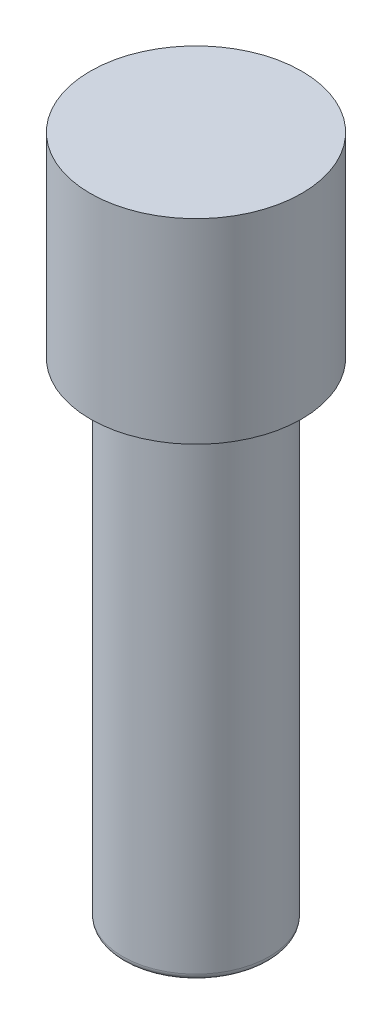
ISO-10303-21;
HEADER;
FILE_DESCRIPTION(('STEP AP214'),'2;1');
FILE_NAME('part.step','',(''),(''),'','','');
FILE_SCHEMA(('AUTOMOTIVE_DESIGN { 1 0 10303 214 1 1 1 1 }'));
ENDSEC;
DATA;
#1=APPLICATION_CONTEXT('core data for automotive mechanical design processes');
#2=APPLICATION_PROTOCOL_DEFINITION('international standard','automotive_design',2000,#1);
#3=PRODUCT_CONTEXT('',#1,'mechanical');
#4=PRODUCT('Part','Part','',(#3));
#5=PRODUCT_RELATED_PRODUCT_CATEGORY('part','',(#4));
#6=PRODUCT_DEFINITION_FORMATION('','',#4);
#7=PRODUCT_DEFINITION_CONTEXT('part definition',#1,'design');
#8=PRODUCT_DEFINITION('design','',#6,#7);
#9=PRODUCT_DEFINITION_SHAPE('','',#8);
#10=(LENGTH_UNIT() NAMED_UNIT(*) SI_UNIT(.MILLI.,.METRE.));
#11=(NAMED_UNIT(*) PLANE_ANGLE_UNIT() SI_UNIT($,.RADIAN.));
#12=(NAMED_UNIT(*) SI_UNIT($,.STERADIAN.) SOLID_ANGLE_UNIT());
#13=UNCERTAINTY_MEASURE_WITH_UNIT(LENGTH_MEASURE(1.E-05),#10,'distance_accuracy_value','');
#14=(GEOMETRIC_REPRESENTATION_CONTEXT(3) GLOBAL_UNCERTAINTY_ASSIGNED_CONTEXT((#13)) GLOBAL_UNIT_ASSIGNED_CONTEXT((#10,
#11,#12)) REPRESENTATION_CONTEXT('',''));
#15=CARTESIAN_POINT('',(0.,0.,0.));
#16=DIRECTION('',(0.,0.,1.));
#17=DIRECTION('',(1.,0.,0.));
#18=AXIS2_PLACEMENT_3D('',#15,#16,#17);
#19=CARTESIAN_POINT('',(0.,0.,0.));
#20=DIRECTION('',(0.,1.,0.));
#21=DIRECTION('',(0.,0.,1.));
#22=AXIS2_PLACEMENT_3D('',#19,#20,#21);
#23=PLANE('',#22);
#24=CARTESIAN_POINT('',(0.,0.,0.));
#25=DIRECTION('',(0.,1.,0.));
#26=DIRECTION('',(0.,0.,1.));
#27=AXIS2_PLACEMENT_3D('',#24,#25,#26);
#28=CIRCLE('',#27,2.05);
#29=CARTESIAN_POINT('',(0.,0.,2.05));
#30=VERTEX_POINT('',#29);
#31=EDGE_CURVE('E10',#30,#30,#28,.F.);
#32=ORIENTED_EDGE('',*,*,#31,.T.);
#33=EDGE_LOOP('',(#32));
#34=FACE_BOUND('',#33,.T.);
#35=CARTESIAN_POINT('',(0.,0.,0.));
#36=DIRECTION('',(0.,1.,0.));
#37=DIRECTION('',(0.,0.,1.));
#38=AXIS2_PLACEMENT_3D('',#35,#36,#37);
#39=CIRCLE('',#38,1.4);
#40=CARTESIAN_POINT('',(0.,0.,1.4));
#41=VERTEX_POINT('',#40);
#42=EDGE_CURVE('E42',#41,#41,#39,.T.);
#43=ORIENTED_EDGE('',*,*,#42,.T.);
#44=EDGE_LOOP('',(#43));
#45=FACE_BOUND('',#44,.T.);
#46=ADVANCED_FACE('F31',(#34,#45),#23,.F.);
#47=CARTESIAN_POINT('',(0.,10.,0.));
#48=DIRECTION('',(0.,-1.,0.));
#49=DIRECTION('',(0.,0.,-1.));
#50=AXIS2_PLACEMENT_3D('',#47,#48,#49);
#51=CYLINDRICAL_SURFACE('',#50,2.25);
#52=CARTESIAN_POINT('',(0.,0.200000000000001,0.));
#53=DIRECTION('',(0.,1.,0.));
#54=DIRECTION('',(0.,0.,1.));
#55=AXIS2_PLACEMENT_3D('',#52,#53,#54);
#56=CIRCLE('',#55,2.25);
#57=CARTESIAN_POINT('',(0.,0.200000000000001,2.25));
#58=VERTEX_POINT('',#57);
#59=EDGE_CURVE('E38',#58,#58,#56,.T.);
#60=ORIENTED_EDGE('',*,*,#59,.T.);
#61=EDGE_LOOP('',(#60));
#62=FACE_BOUND('',#61,.T.);
#63=CARTESIAN_POINT('',(0.,15.,0.));
#64=DIRECTION('',(0.,1.,0.));
#65=DIRECTION('',(0.,0.,1.));
#66=AXIS2_PLACEMENT_3D('',#63,#64,#65);
#67=CIRCLE('',#66,2.25);
#68=CARTESIAN_POINT('',(0.,15.,2.25));
#69=VERTEX_POINT('',#68);
#70=EDGE_CURVE('E51',#69,#69,#67,.T.);
#71=ORIENTED_EDGE('',*,*,#70,.F.);
#72=EDGE_LOOP('',(#71));
#73=FACE_BOUND('',#72,.T.);
#74=ADVANCED_FACE('F78',(#62,#73),#51,.T.);
#75=CARTESIAN_POINT('',(0.,10.,0.));
#76=DIRECTION('',(0.,-1.,0.));
#77=DIRECTION('',(0.,0.,-1.));
#78=AXIS2_PLACEMENT_3D('',#75,#76,#77);
#79=CYLINDRICAL_SURFACE('',#78,1.4);
#80=CARTESIAN_POINT('',(0.,10.,0.));
#81=DIRECTION('',(0.,1.,0.));
#82=DIRECTION('',(0.,0.,1.));
#83=AXIS2_PLACEMENT_3D('',#80,#81,#82);
#84=CIRCLE('',#83,1.4);
#85=CARTESIAN_POINT('',(0.,10.,1.4));
#86=VERTEX_POINT('',#85);
#87=EDGE_CURVE('E46',#86,#86,#84,.T.);
#88=ORIENTED_EDGE('',*,*,#87,.T.);
#89=EDGE_LOOP('',(#88));
#90=FACE_BOUND('',#89,.T.);
#91=ORIENTED_EDGE('',*,*,#42,.F.);
#92=EDGE_LOOP('',(#91));
#93=FACE_BOUND('',#92,.T.);
#94=ADVANCED_FACE('F83',(#90,#93),#79,.F.);
#95=CARTESIAN_POINT('',(0.,10.,0.));
#96=DIRECTION('',(0.,1.,0.));
#97=DIRECTION('',(0.,0.,1.));
#98=AXIS2_PLACEMENT_3D('',#95,#96,#97);
#99=PLANE('',#98);
#100=ORIENTED_EDGE('',*,*,#87,.F.);
#101=EDGE_LOOP('',(#100));
#102=FACE_BOUND('',#101,.T.);
#103=ADVANCED_FACE('F88',(#102),#99,.F.);
#104=CARTESIAN_POINT('',(0.,0.200000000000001,0.));
#105=DIRECTION('',(0.,1.,0.));
#106=DIRECTION('',(0.,0.,1.));
#107=AXIS2_PLACEMENT_3D('',#104,#105,#106);
#108=TOROIDAL_SURFACE('',#107,2.05,0.2);
#109=ORIENTED_EDGE('',*,*,#31,.F.);
#110=EDGE_LOOP('',(#109));
#111=FACE_BOUND('',#110,.T.);
#112=ORIENTED_EDGE('',*,*,#59,.F.);
#113=EDGE_LOOP('',(#112));
#114=FACE_BOUND('',#113,.T.);
#115=ADVANCED_FACE('F33',(#111,#114),#108,.T.);
#116=CARTESIAN_POINT('',(0.,21.,0.));
#117=DIRECTION('',(0.,-1.,0.));
#118=DIRECTION('',(0.,0.,-1.));
#119=AXIS2_PLACEMENT_3D('',#116,#117,#118);
#120=CYLINDRICAL_SURFACE('',#119,3.25);
#121=CARTESIAN_POINT('',(0.,21.,0.));
#122=DIRECTION('',(0.,1.,0.));
#123=DIRECTION('',(0.,0.,1.));
#124=AXIS2_PLACEMENT_3D('',#121,#122,#123);
#125=CIRCLE('',#124,3.25);
#126=CARTESIAN_POINT('',(0.,21.,3.25));
#127=VERTEX_POINT('',#126);
#128=EDGE_CURVE('E54',#127,#127,#125,.T.);
#129=ORIENTED_EDGE('',*,*,#128,.F.);
#130=EDGE_LOOP('',(#129));
#131=FACE_BOUND('',#130,.T.);
#132=CARTESIAN_POINT('',(0.,15.,0.));
#133=DIRECTION('',(0.,1.,0.));
#134=DIRECTION('',(0.,0.,1.));
#135=AXIS2_PLACEMENT_3D('',#132,#133,#134);
#136=CIRCLE('',#135,3.25);
#137=CARTESIAN_POINT('',(0.,15.,3.25));
#138=VERTEX_POINT('',#137);
#139=EDGE_CURVE('E55',#138,#138,#136,.T.);
#140=ORIENTED_EDGE('',*,*,#139,.T.);
#141=EDGE_LOOP('',(#140));
#142=FACE_BOUND('',#141,.T.);
#143=ADVANCED_FACE('F63',(#131,#142),#120,.T.);
#144=CARTESIAN_POINT('',(0.,21.,0.));
#145=DIRECTION('',(0.,1.,0.));
#146=DIRECTION('',(0.,0.,1.));
#147=AXIS2_PLACEMENT_3D('',#144,#145,#146);
#148=PLANE('',#147);
#149=ORIENTED_EDGE('',*,*,#128,.T.);
#150=EDGE_LOOP('',(#149));
#151=FACE_BOUND('',#150,.T.);
#152=ADVANCED_FACE('F61',(#151),#148,.T.);
#153=CARTESIAN_POINT('',(0.,15.,0.));
#154=DIRECTION('',(0.,1.,0.));
#155=DIRECTION('',(0.,0.,1.));
#156=AXIS2_PLACEMENT_3D('',#153,#154,#155);
#157=PLANE('',#156);
#158=ORIENTED_EDGE('',*,*,#70,.T.);
#159=EDGE_LOOP('',(#158));
#160=FACE_BOUND('',#159,.T.);
#161=ORIENTED_EDGE('',*,*,#139,.F.);
#162=EDGE_LOOP('',(#161));
#163=FACE_BOUND('',#162,.T.);
#164=ADVANCED_FACE('F69',(#160,#163),#157,.F.);
#165=CLOSED_SHELL('',(#46,#74,#94,#103,#115,#143,#152,#164));
#166=MANIFOLD_SOLID_BREP('B2',#165);
#167=ADVANCED_BREP_SHAPE_REPRESENTATION('',(#18,#166),#14);
#168=SHAPE_DEFINITION_REPRESENTATION(#9,#167);
ENDSEC;
END-ISO-10303-21;
